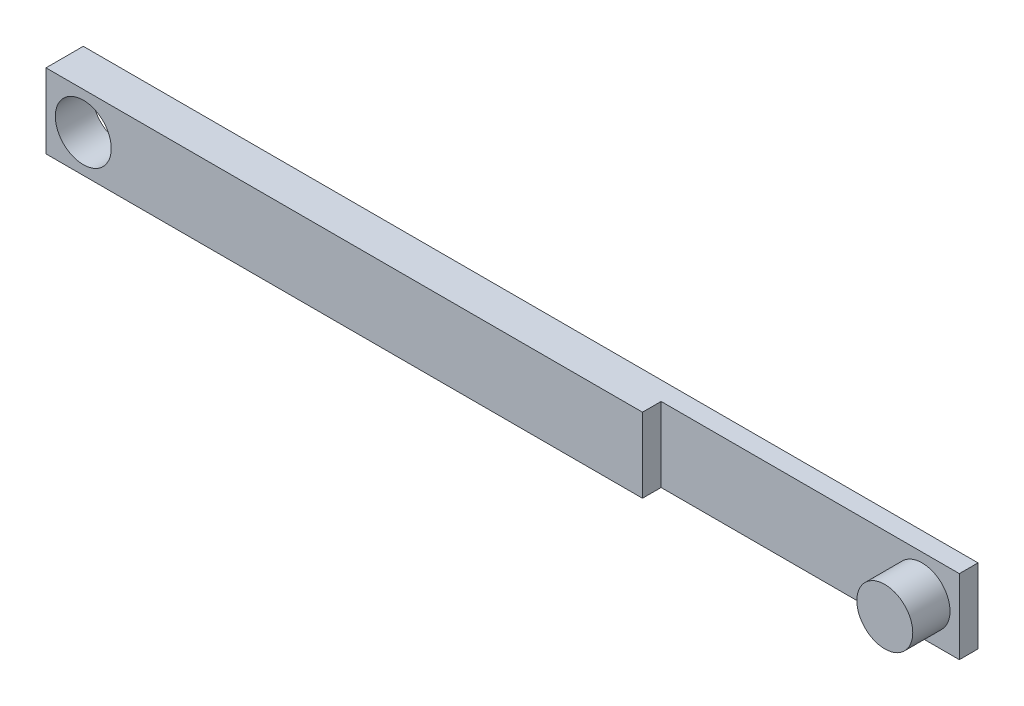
from build123d import *

# Parameters (mm, degrees)
SKETCH_1_W          = 240
SKETCH_1_H          = 20
EXTRUDE_1_DEPTH     = 10
SKETCH_2_R          = 7.5
CUT_EXTRUDE_2_DEPTH = 242.039415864
SKETCH_3_W          = 80
SKETCH_3_H          = 20
CUT_EXTRUDE_3_DEPTH = 5
SKETCH_4_R          = 7.5
EXTRUDE_4_DEPTH     = 10


with BuildPart() as part:
    # Sketch 1 → Extrude 1 (new body)
    with BuildSketch(Plane.XY):
        with Locations((120, 10)):
            Rectangle(SKETCH_1_W, SKETCH_1_H)
    extrude(amount=EXTRUDE_1_DEPTH)

    # Sketch 2 → Cut-Extrude 2 (cut, through all)
    with BuildSketch(Plane.XY.offset(10)):
        with Locations((10, 10)):
            Circle(SKETCH_2_R)
    extrude(amount=-CUT_EXTRUDE_2_DEPTH, mode=Mode.SUBTRACT)

    # Sketch 3 → Cut-Extrude 3 (cut)
    with BuildSketch(Plane.XY.offset(10)):
        with Locations((200, 10)):
            Rectangle(SKETCH_3_W, SKETCH_3_H)
    extrude(amount=-CUT_EXTRUDE_3_DEPTH, mode=Mode.SUBTRACT)

    # Sketch 4 → Extrude 4 (add)
    with BuildSketch(Plane.XY.offset(5)):
        with Locations(Location((230, 10, 0), (0, 0, 180))):
            Circle(SKETCH_4_R)
    extrude(amount=EXTRUDE_4_DEPTH)


solid = part.part
